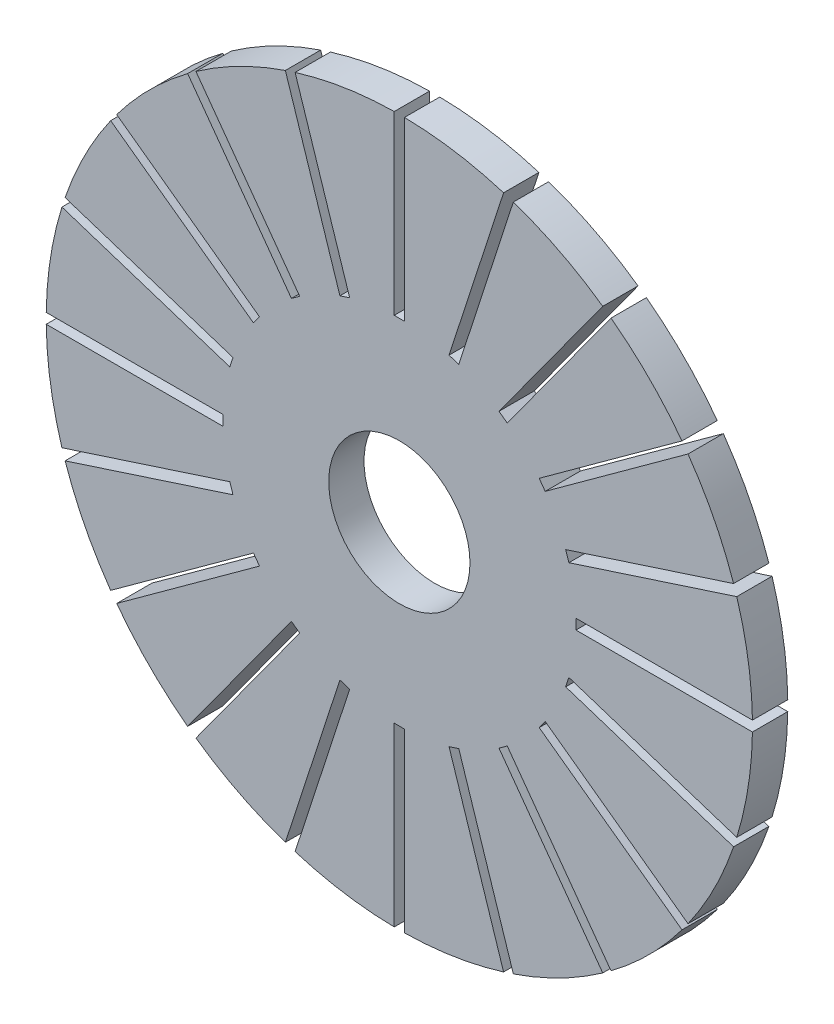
from build123d import *

# Parameters (mm, degrees)
SKETCH2_R           = 20
BOSS_EXTRUDE1_DEPTH = 10


with BuildPart() as part:
    # Sketch2 → Boss-Extrude1 (new body)
    with BuildSketch(Plane.XY):
        with BuildLine():
            Line((32.277482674, 94.64757848), (16.829881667, 47.104751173))
            Line((16.829881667, 47.104751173), (14.07181777, 48.000900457))
            Line((14.07181777, 48.000900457), (29.519418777, 95.543727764))
            ThreePointArc((29.519418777, 95.543727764), (15.643446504, 98.76883406), (1.45, 99.989486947))
            Line((1.45, 99.989486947), (1.45, 50))
            Line((1.45, 50), (-1.45, 50))
            Line((-1.45, 50), (-1.45, 99.989486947))
            ThreePointArc((-1.45, 99.989486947), (-15.643446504, 98.76883406), (-29.519418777, 95.543727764))
            Line((-29.519418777, 95.543727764), (-14.07181777, 48.000900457))
            Line((-14.07181777, 48.000900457), (-16.829881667, 47.104751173))
            Line((-16.829881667, 47.104751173), (-32.277482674, 94.64757848))
            ThreePointArc((-32.277482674, 94.64757848), (-45.399049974, 89.100652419), (-57.59927117, 81.745482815))
            Line((-57.59927117, 81.745482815), (-28.216187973, 41.303138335))
            Line((-28.216187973, 41.303138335), (-30.562337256, 39.598561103))
            Line((-30.562337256, 39.598561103), (-59.945420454, 80.040905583))
            ThreePointArc((-59.945420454, 80.040905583), (-70.710678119, 70.710678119), (-80.040905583, 59.945420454))
            Line((-80.040905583, 59.945420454), (-39.598561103, 30.562337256))
            Line((-39.598561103, 30.562337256), (-41.303138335, 28.216187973))
            Line((-41.303138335, 28.216187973), (-81.745482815, 57.59927117))
            ThreePointArc((-81.745482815, 57.59927117), (-89.100652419, 45.399049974), (-94.64757848, 32.277482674))
            Line((-94.64757848, 32.277482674), (-47.104751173, 16.829881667))
            Line((-47.104751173, 16.829881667), (-48.000900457, 14.07181777))
            Line((-48.000900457, 14.07181777), (-95.543727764, 29.519418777))
            ThreePointArc((-95.543727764, 29.519418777), (-98.76883406, 15.643446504), (-99.989486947, 1.45))
            Line((-99.989486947, 1.45), (-50, 1.45))
            Line((-50, 1.45), (-50, -1.45))
            Line((-50, -1.45), (-99.989486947, -1.45))
            ThreePointArc((-99.989486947, -1.45), (-98.76883406, -15.643446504), (-95.543727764, -29.519418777))
            Line((-95.543727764, -29.519418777), (-48.000900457, -14.07181777))
            Line((-48.000900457, -14.07181777), (-47.104751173, -16.829881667))
            Line((-47.104751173, -16.829881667), (-94.64757848, -32.277482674))
            ThreePointArc((-94.64757848, -32.277482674), (-89.100652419, -45.399049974), (-81.745482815, -57.59927117))
            Line((-81.745482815, -57.59927117), (-41.303138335, -28.216187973))
            Line((-41.303138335, -28.216187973), (-39.598561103, -30.562337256))
            Line((-39.598561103, -30.562337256), (-80.040905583, -59.945420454))
            ThreePointArc((-80.040905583, -59.945420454), (-70.710678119, -70.710678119), (-59.945420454, -80.040905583))
            Line((-59.945420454, -80.040905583), (-30.562337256, -39.598561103))
            Line((-30.562337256, -39.598561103), (-28.216187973, -41.303138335))
            Line((-28.216187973, -41.303138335), (-57.59927117, -81.745482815))
            ThreePointArc((-57.59927117, -81.745482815), (-45.399049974, -89.100652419), (-32.277482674, -94.64757848))
            Line((-32.277482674, -94.64757848), (-16.829881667, -47.104751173))
            Line((-16.829881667, -47.104751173), (-14.07181777, -48.000900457))
            Line((-14.07181777, -48.000900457), (-29.519418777, -95.543727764))
            ThreePointArc((-29.519418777, -95.543727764), (-15.643446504, -98.76883406), (-1.45, -99.989486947))
            Line((-1.45, -99.989486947), (-1.45, -50))
            Line((-1.45, -50), (1.45, -50))
            Line((1.45, -50), (1.45, -99.989486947))
            ThreePointArc((1.45, -99.989486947), (15.643446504, -98.76883406), (29.519418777, -95.543727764))
            Line((29.519418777, -95.543727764), (14.07181777, -48.000900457))
            Line((14.07181777, -48.000900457), (16.829881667, -47.104751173))
            Line((16.829881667, -47.104751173), (32.277482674, -94.64757848))
            ThreePointArc((32.277482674, -94.64757848), (45.399049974, -89.100652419), (57.59927117, -81.745482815))
            Line((57.59927117, -81.745482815), (28.216187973, -41.303138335))
            Line((28.216187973, -41.303138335), (30.562337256, -39.598561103))
            Line((30.562337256, -39.598561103), (59.945420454, -80.040905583))
            ThreePointArc((59.945420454, -80.040905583), (70.710678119, -70.710678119), (80.040905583, -59.945420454))
            Line((80.040905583, -59.945420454), (39.598561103, -30.562337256))
            Line((39.598561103, -30.562337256), (41.303138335, -28.216187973))
            Line((41.303138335, -28.216187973), (81.745482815, -57.59927117))
            ThreePointArc((81.745482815, -57.59927117), (89.100652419, -45.399049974), (94.64757848, -32.277482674))
            Line((94.64757848, -32.277482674), (47.104751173, -16.829881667))
            Line((47.104751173, -16.829881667), (48.000900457, -14.07181777))
            Line((48.000900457, -14.07181777), (95.543727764, -29.519418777))
            ThreePointArc((95.543727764, -29.519418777), (98.76883406, -15.643446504), (99.989486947, -1.45))
            Line((99.989486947, -1.45), (50, -1.45))
            Line((50, -1.45), (50, 1.45))
            Line((50, 1.45), (99.989486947, 1.45))
            ThreePointArc((99.989486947, 1.45), (98.76883406, 15.643446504), (95.543727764, 29.519418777))
            Line((95.543727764, 29.519418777), (48.000900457, 14.07181777))
            Line((48.000900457, 14.07181777), (47.104751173, 16.829881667))
            Line((47.104751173, 16.829881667), (94.64757848, 32.277482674))
            ThreePointArc((94.64757848, 32.277482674), (89.100652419, 45.399049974), (81.745482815, 57.59927117))
            Line((81.745482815, 57.59927117), (41.303138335, 28.216187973))
            Line((41.303138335, 28.216187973), (39.598561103, 30.562337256))
            Line((39.598561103, 30.562337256), (80.040905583, 59.945420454))
            ThreePointArc((80.040905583, 59.945420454), (70.710678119, 70.710678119), (59.945420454, 80.040905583))
            Line((59.945420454, 80.040905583), (30.562337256, 39.598561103))
            Line((30.562337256, 39.598561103), (28.216187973, 41.303138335))
            Line((28.216187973, 41.303138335), (57.59927117, 81.745482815))
            ThreePointArc((57.59927117, 81.745482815), (45.399049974, 89.100652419), (32.277482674, 94.64757848))
        make_face()
        Circle(SKETCH2_R, mode=Mode.SUBTRACT)
    extrude(amount=BOSS_EXTRUDE1_DEPTH)


solid = part.part
